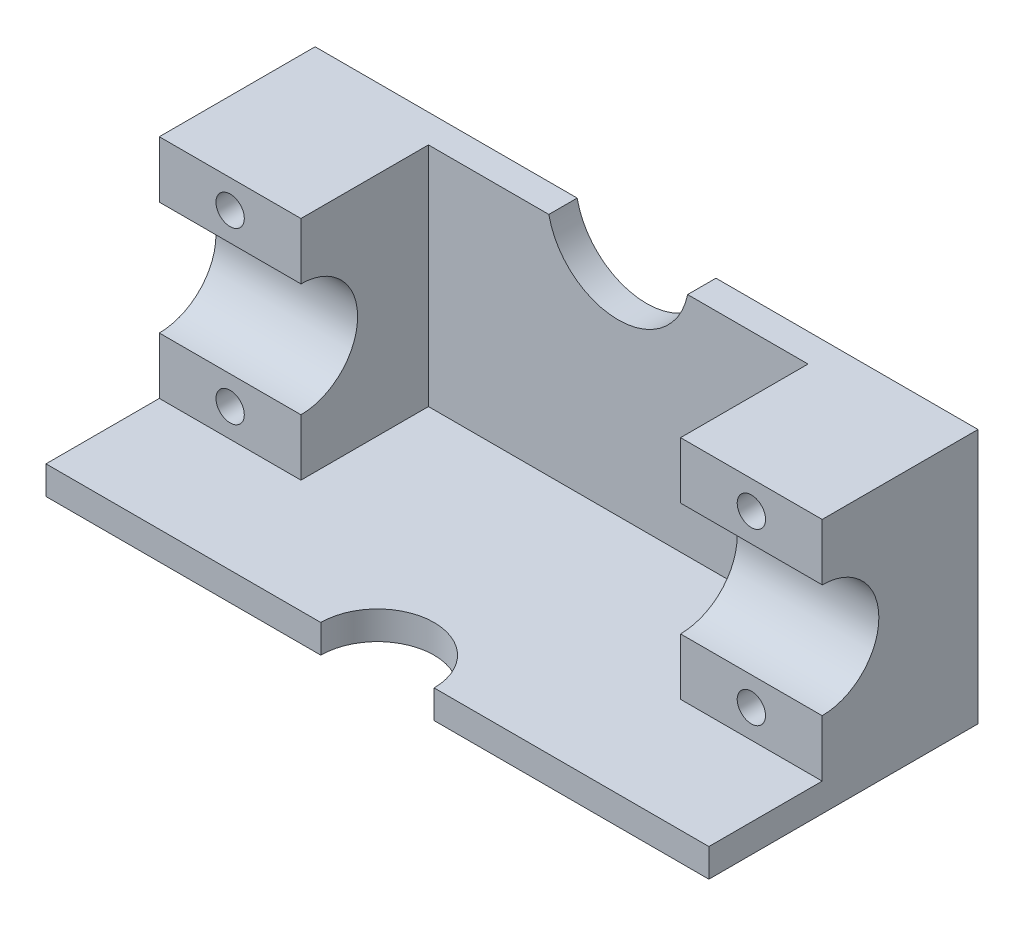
from build123d import *

# Parameters (mm, degrees)
BOSS_EXTRU_1_DEPTH      = 2
ESQUISSE5_W             = 10
ESQUISSE5_H             = 16
BOSS_EXTRU_2_DEPTH      = 17
ESQUISSE6_R             = 4
ENL_V_MAT_EXTRU_1_DEPTH = 49
BOSS_EXTRU_4_DEPTH      = 2
ESQUISSE8_W             = 10
ESQUISSE8_H             = 16
ENL_V_MAT_EXTRU_2_DEPTH = 8
ESQUISSE10_R            = 1
ENL_V_MAT_EXTRU_3_DEPTH = 13


with BuildPart() as part:
    # Esquisse2 → Boss.-Extru.1 (new body)
    with BuildSketch(Plane.XY):
        with BuildLine():
            Line((-23.4, 8), (-4.898979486, 8))
            ThreePointArc((-4.898979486, 8), (0, 4), (4.898979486, 8))
            Line((4.898979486, 8), (23.4, 8))
            Line((23.4, 8), (23.4, -8))
            Line((23.4, -8), (-23.4, -8))
            Line((-23.4, -8), (-23.4, 8))
        make_face()
    extrude(amount=BOSS_EXTRU_1_DEPTH)

    # Esquisse5 → Boss.-Extru.2 (add)
    with BuildSketch(Plane.XY.offset(2)):
        with Locations((-18.4, 0)):
            Rectangle(ESQUISSE5_W, ESQUISSE5_H)
        with Locations((18.4, 0)):
            Rectangle(ESQUISSE5_W, ESQUISSE5_H)
    extrude(amount=BOSS_EXTRU_2_DEPTH)

    # Esquisse6 → Enl_v. mat.-Extru.1 (cut)
    with BuildSketch(Plane.ZY.offset(23.4)):
        with Locations((11, 0)):
            Circle(ESQUISSE6_R)
    extrude(amount=-ENL_V_MAT_EXTRU_1_DEPTH, mode=Mode.SUBTRACT)

    # Esquisse7 → Boss.-Extru.4 (add)
    with BuildSketch(Plane.XZ.offset(8)):
        with BuildLine():
            Line((4, 19), (23.4, 19))
            Line((23.4, 19), (23.4, 0))
            Line((23.4, 0), (-23.4, 0))
            Line((-23.4, 0), (-23.4, 19))
            Line((-23.4, 19), (-4, 19))
            ThreePointArc((-4, 19), (0, 15), (4, 19))
        make_face()
    extrude(amount=BOSS_EXTRU_4_DEPTH)

    # Esquisse8 → Enl_v. mat.-Extru.2 (cut)
    with BuildSketch(Plane.XY.offset(19)):
        with Locations((-18.4, 0)):
            Rectangle(ESQUISSE8_W, ESQUISSE8_H)
        with Locations((18.4, 0)):
            Rectangle(ESQUISSE8_W, ESQUISSE8_H)
    extrude(amount=-ENL_V_MAT_EXTRU_2_DEPTH, mode=Mode.SUBTRACT)

    # Esquisse10 → Enl_v. mat.-Extru.3 (cut)
    with BuildSketch(Plane.XY.offset(11)):
        with Locations((-18.4, 6)):
            Circle(ESQUISSE10_R)
        with Locations((-18.4, -6)):
            Circle(ESQUISSE10_R)
        with Locations((18.4, -6)):
            Circle(ESQUISSE10_R)
        with Locations((18.4, 6)):
            Circle(ESQUISSE10_R)
    extrude(amount=-ENL_V_MAT_EXTRU_3_DEPTH, mode=Mode.SUBTRACT)


solid = part.part
